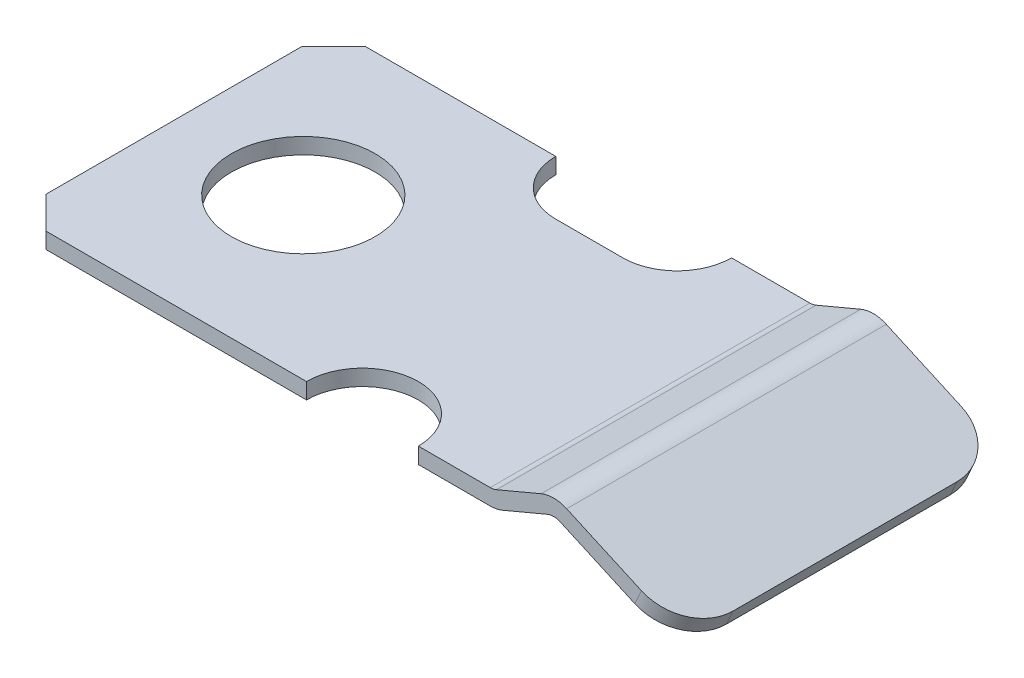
from build123d import *

# Parameters (mm, degrees)
EXTRUSION1_DEPTH        = 5
ESQUISSE2_R             = 2.25
ESQUISSE2_R_2           = 1.75
ENL_V_MAT_EXTRU_1_DEPTH = 10
CHANFREIN1_SIZE         = 1
CONG_1_R                = 1.5


with BuildPart() as part:
    # Esquisse1 → Extrusion1 (new, symmetric)
    with BuildSketch(Plane.XY):
        with BuildLine():
            Line((15.287694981, 0.078722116), (16.688265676, 0.669954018))
            ThreePointArc((16.688265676, 0.669954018), (16.888404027, 0.709282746), (17.0875962, 0.665412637))
            Line((17.0875962, 0.665412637), (20.795121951, -1))
            Line((20.795121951, -1), (21, -0.543902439))
            Line((21, -0.543902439), (17.292474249, 1.121510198))
            ThreePointArc((17.292474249, 1.121510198), (16.894089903, 1.209250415), (16.493813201, 1.13059296))
            Line((16.493813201, 1.13059296), (15.093242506, 0.539361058))
            ThreePointArc((15.093242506, 0.539361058), (14.997988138, 0.509939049), (14.898790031, 0.5))
            Line((14.898790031, 0.5), (0, 0.5))
            Line((0, 0.5), (0, 0))
            Line((0, 0), (14.898790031, 0))
            ThreePointArc((14.898790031, 0), (15.097186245, 0.019878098), (15.287694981, 0.078722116))
        make_face()
    extrude(amount=EXTRUSION1_DEPTH, both=True)

    # Esquisse2 → Enl_v. mat.-Extru.1 (cut)
    with BuildSketch(Plane(origin=(0, 0.5, 0), x_dir=(-1, 0, 0), z_dir=(0, 1, 0))):
        with Locations((-4.05, 0)):
            Circle(ESQUISSE2_R)
        with Locations((-10.9, 5)):
            Circle(ESQUISSE2_R_2)
        with BuildLine():
            Line((-10.75, -3.3), (-8.65, -3.3))
            ThreePointArc((-8.65, -3.3), (-7.447918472, -3.797918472), (-6.95, -5))
            Line((-6.95, -5), (-12.45, -5))
            ThreePointArc((-12.45, -5), (-11.952081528, -3.797918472), (-10.75, -3.3))
        make_face()
    extrude(amount=-ENL_V_MAT_EXTRU_1_DEPTH, mode=Mode.SUBTRACT)

    # Chanfrein1
    chanfrein1_edges = [part.edges().sort_by_distance(p)[0] for p in [
        (0, 0.25, -5),
        (0, 0.25, 5),
    ]]
    chamfer(chanfrein1_edges, length=CHANFREIN1_SIZE)

    # Cong_1
    cong_1_edges = [part.edges().sort_by_distance(p)[0] for p in [
        (20.897560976, -0.77195122, -5),
        (20.897560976, -0.77195122, 5),
    ]]
    fillet(cong_1_edges, radius=CONG_1_R)


solid = part.part
